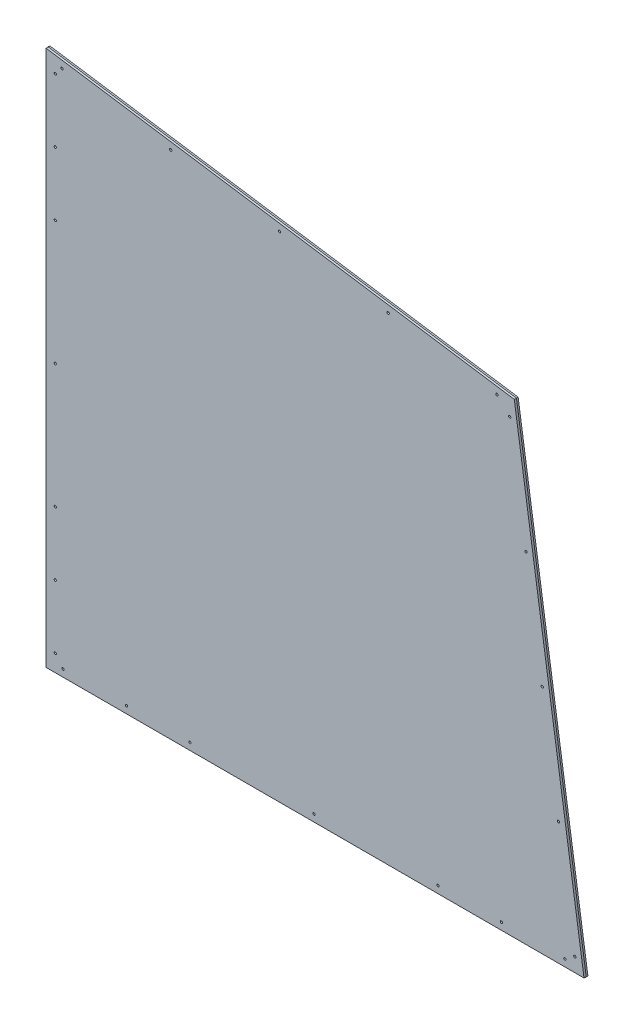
ISO-10303-21;
HEADER;
FILE_DESCRIPTION(('STEP AP214'),'2;1');
FILE_NAME('part.step','',(''),(''),'','','');
FILE_SCHEMA(('AUTOMOTIVE_DESIGN { 1 0 10303 214 1 1 1 1 }'));
ENDSEC;
DATA;
#1=APPLICATION_CONTEXT('core data for automotive mechanical design processes');
#2=APPLICATION_PROTOCOL_DEFINITION('international standard','automotive_design',2000,#1);
#3=PRODUCT_CONTEXT('',#1,'mechanical');
#4=PRODUCT('Part','Part','',(#3));
#5=PRODUCT_RELATED_PRODUCT_CATEGORY('part','',(#4));
#6=PRODUCT_DEFINITION_FORMATION('','',#4);
#7=PRODUCT_DEFINITION_CONTEXT('part definition',#1,'design');
#8=PRODUCT_DEFINITION('design','',#6,#7);
#9=PRODUCT_DEFINITION_SHAPE('','',#8);
#10=(LENGTH_UNIT() NAMED_UNIT(*) SI_UNIT(.MILLI.,.METRE.));
#11=(NAMED_UNIT(*) PLANE_ANGLE_UNIT() SI_UNIT($,.RADIAN.));
#12=(NAMED_UNIT(*) SI_UNIT($,.STERADIAN.) SOLID_ANGLE_UNIT());
#13=UNCERTAINTY_MEASURE_WITH_UNIT(LENGTH_MEASURE(1.E-05),#10,'distance_accuracy_value','');
#14=(GEOMETRIC_REPRESENTATION_CONTEXT(3) GLOBAL_UNCERTAINTY_ASSIGNED_CONTEXT((#13)) GLOBAL_UNIT_ASSIGNED_CONTEXT((#10,
#11,#12)) REPRESENTATION_CONTEXT('',''));
#15=CARTESIAN_POINT('',(0.,0.,0.));
#16=DIRECTION('',(0.,0.,1.));
#17=DIRECTION('',(1.,0.,0.));
#18=AXIS2_PLACEMENT_3D('',#15,#16,#17);
#19=CARTESIAN_POINT('',(0.,4.365625,4.365625));
#20=DIRECTION('',(0.,1.,0.));
#21=DIRECTION('',(0.,0.,1.));
#22=AXIS2_PLACEMENT_3D('',#19,#20,#21);
#23=PLANE('',#22);
#24=DIRECTION('',(1.,0.,0.));
#25=VECTOR('',#24,1.);
#26=CARTESIAN_POINT('',(0.,4.365625,-4.365625));
#27=LINE('',#26,#25);
#28=CARTESIAN_POINT('',(0.,4.365625,-4.365625));
#29=VERTEX_POINT('',#28);
#30=CARTESIAN_POINT('',(1211.54426241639,4.365625,-4.365625));
#31=VERTEX_POINT('',#30);
#32=EDGE_CURVE('E97',#29,#31,#27,.T.);
#33=ORIENTED_EDGE('',*,*,#32,.T.);
#34=DIRECTION('',(-0.147902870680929,0.,-0.989001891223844));
#35=VECTOR('',#34,1.);
#36=CARTESIAN_POINT('',(1212.19713120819,4.365625,0.));
#37=LINE('',#36,#35);
#38=CARTESIAN_POINT('',(1212.19713120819,4.365625,0.));
#39=VERTEX_POINT('',#38);
#40=EDGE_CURVE('E81',#39,#31,#37,.T.);
#41=ORIENTED_EDGE('',*,*,#40,.F.);
#42=DIRECTION('',(0.147902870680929,0.,-0.989001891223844));
#43=VECTOR('',#42,1.);
#44=CARTESIAN_POINT('',(1212.19713120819,4.365625,0.));
#45=LINE('',#44,#43);
#46=CARTESIAN_POINT('',(1211.54426241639,4.365625,4.365625));
#47=VERTEX_POINT('',#46);
#48=EDGE_CURVE('E89',#47,#39,#45,.T.);
#49=ORIENTED_EDGE('',*,*,#48,.F.);
#50=DIRECTION('',(1.,0.,0.));
#51=VECTOR('',#50,1.);
#52=CARTESIAN_POINT('',(0.,4.365625,4.365625));
#53=LINE('',#52,#51);
#54=CARTESIAN_POINT('',(0.,4.365625,4.365625));
#55=VERTEX_POINT('',#54);
#56=EDGE_CURVE('E107',#55,#47,#53,.T.);
#57=ORIENTED_EDGE('',*,*,#56,.F.);
#58=DIRECTION('',(0.,0.,-1.));
#59=VECTOR('',#58,1.);
#60=CARTESIAN_POINT('',(0.,4.365625,4.365625));
#61=LINE('',#60,#59);
#62=EDGE_CURVE('E103',#55,#29,#61,.T.);
#63=ORIENTED_EDGE('',*,*,#62,.T.);
#64=EDGE_LOOP('',(#33,#41,#49,#57,#63));
#65=FACE_BOUND('',#64,.T.);
#66=ADVANCED_FACE('F32',(#65),#23,.F.);
#67=CARTESIAN_POINT('',(0.,4.365625,4.365625));
#68=DIRECTION('',(1.,0.,0.));
#69=DIRECTION('',(0.,1.,0.));
#70=AXIS2_PLACEMENT_3D('',#67,#68,#69);
#71=PLANE('',#70);
#72=DIRECTION('',(0.,-0.147902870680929,0.989001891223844));
#73=VECTOR('',#72,1.);
#74=CARTESIAN_POINT('',(0.,1212.85,0.));
#75=LINE('',#74,#73);
#76=CARTESIAN_POINT('',(0.,1212.85,0.));
#77=VERTEX_POINT('',#76);
#78=CARTESIAN_POINT('',(0.,1212.19713120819,4.365625));
#79=VERTEX_POINT('',#78);
#80=EDGE_CURVE('E109',#77,#79,#75,.T.);
#81=ORIENTED_EDGE('',*,*,#80,.F.);
#82=DIRECTION('',(0.,0.147902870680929,0.989001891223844));
#83=VECTOR('',#82,1.);
#84=CARTESIAN_POINT('',(0.,1212.85,0.));
#85=LINE('',#84,#83);
#86=CARTESIAN_POINT('',(0.,1212.19713120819,-4.365625));
#87=VERTEX_POINT('',#86);
#88=EDGE_CURVE('E126',#87,#77,#85,.T.);
#89=ORIENTED_EDGE('',*,*,#88,.F.);
#90=DIRECTION('',(0.,-1.,0.));
#91=VECTOR('',#90,1.);
#92=CARTESIAN_POINT('',(0.,4.365625,-4.365625));
#93=LINE('',#92,#91);
#94=EDGE_CURVE('E104',#87,#29,#93,.T.);
#95=ORIENTED_EDGE('',*,*,#94,.T.);
#96=ORIENTED_EDGE('',*,*,#62,.F.);
#97=DIRECTION('',(0.,-1.,0.));
#98=VECTOR('',#97,1.);
#99=CARTESIAN_POINT('',(0.,4.365625,4.365625));
#100=LINE('',#99,#98);
#101=EDGE_CURVE('E55',#79,#55,#100,.T.);
#102=ORIENTED_EDGE('',*,*,#101,.F.);
#103=EDGE_LOOP('',(#81,#89,#95,#96,#102));
#104=FACE_BOUND('',#103,.T.);
#105=ADVANCED_FACE('F133',(#104),#71,.F.);
#106=CARTESIAN_POINT('',(0.,0.,4.365625));
#107=DIRECTION('',(0.,0.,1.));
#108=DIRECTION('',(1.,0.,0.));
#109=AXIS2_PLACEMENT_3D('',#106,#107,#108);
#110=PLANE('',#109);
#111=CARTESIAN_POINT('',(280.602864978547,1154.13041917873,4.365625));
#112=DIRECTION('',(0.,0.,1.));
#113=DIRECTION('',(1.,0.,0.));
#114=AXIS2_PLACEMENT_3D('',#111,#112,#113);
#115=CIRCLE('',#114,2.57937000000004);
#116=CARTESIAN_POINT('',(283.182234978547,1154.13041917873,4.365625));
#117=VERTEX_POINT('',#116);
#118=EDGE_CURVE('E277',#117,#117,#115,.T.);
#119=ORIENTED_EDGE('',*,*,#118,.F.);
#120=EDGE_LOOP('',(#119));
#121=FACE_BOUND('',#120,.T.);
#122=CARTESIAN_POINT('',(35.6765466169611,1190.75856510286,4.365625));
#123=DIRECTION('',(0.,0.,1.));
#124=DIRECTION('',(1.,0.,0.));
#125=AXIS2_PLACEMENT_3D('',#122,#123,#124);
#126=CIRCLE('',#125,2.57937000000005);
#127=CARTESIAN_POINT('',(38.2559166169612,1190.75856510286,4.365625));
#128=VERTEX_POINT('',#127);
#129=EDGE_CURVE('E271',#128,#128,#126,.T.);
#130=ORIENTED_EDGE('',*,*,#129,.F.);
#131=EDGE_LOOP('',(#130));
#132=FACE_BOUND('',#131,.T.);
#133=CARTESIAN_POINT('',(20.6375,1172.765625,4.365625));
#134=DIRECTION('',(0.,0.,1.));
#135=DIRECTION('',(1.,0.,0.));
#136=AXIS2_PLACEMENT_3D('',#133,#134,#135);
#137=CIRCLE('',#136,2.57937000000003);
#138=CARTESIAN_POINT('',(23.21687,1172.765625,4.365625));
#139=VERTEX_POINT('',#138);
#140=EDGE_CURVE('E265',#139,#139,#137,.T.);
#141=ORIENTED_EDGE('',*,*,#140,.F.);
#142=EDGE_LOOP('',(#141));
#143=FACE_BOUND('',#142,.T.);
#144=CARTESIAN_POINT('',(20.6375,1029.890625,4.365625));
#145=DIRECTION('',(0.,0.,1.));
#146=DIRECTION('',(1.,0.,0.));
#147=AXIS2_PLACEMENT_3D('',#144,#145,#146);
#148=CIRCLE('',#147,2.57937000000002);
#149=CARTESIAN_POINT('',(23.21687,1029.890625,4.365625));
#150=VERTEX_POINT('',#149);
#151=EDGE_CURVE('E259',#150,#150,#148,.T.);
#152=ORIENTED_EDGE('',*,*,#151,.F.);
#153=EDGE_LOOP('',(#152));
#154=FACE_BOUND('',#153,.T.);
#155=CARTESIAN_POINT('',(20.6375,887.015625,4.365625));
#156=DIRECTION('',(0.,0.,1.));
#157=DIRECTION('',(1.,0.,0.));
#158=AXIS2_PLACEMENT_3D('',#155,#156,#157);
#159=CIRCLE('',#158,2.57936999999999);
#160=CARTESIAN_POINT('',(23.21687,887.015625,4.365625));
#161=VERTEX_POINT('',#160);
#162=EDGE_CURVE('E253',#161,#161,#159,.T.);
#163=ORIENTED_EDGE('',*,*,#162,.F.);
#164=EDGE_LOOP('',(#163));
#165=FACE_BOUND('',#164,.T.);
#166=CARTESIAN_POINT('',(20.6375,607.615625,4.365625));
#167=DIRECTION('',(0.,0.,1.));
#168=DIRECTION('',(1.,0.,0.));
#169=AXIS2_PLACEMENT_3D('',#166,#167,#168);
#170=CIRCLE('',#169,2.57936999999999);
#171=CARTESIAN_POINT('',(23.21687,607.615625,4.365625));
#172=VERTEX_POINT('',#171);
#173=EDGE_CURVE('E247',#172,#172,#170,.T.);
#174=ORIENTED_EDGE('',*,*,#173,.F.);
#175=EDGE_LOOP('',(#174));
#176=FACE_BOUND('',#175,.T.);
#177=CARTESIAN_POINT('',(20.6375,328.215625,4.365625));
#178=DIRECTION('',(0.,0.,1.));
#179=DIRECTION('',(1.,0.,0.));
#180=AXIS2_PLACEMENT_3D('',#177,#178,#179);
#181=CIRCLE('',#180,2.57937000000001);
#182=CARTESIAN_POINT('',(23.21687,328.215625,4.365625));
#183=VERTEX_POINT('',#182);
#184=EDGE_CURVE('E241',#183,#183,#181,.T.);
#185=ORIENTED_EDGE('',*,*,#184,.F.);
#186=EDGE_LOOP('',(#185));
#187=FACE_BOUND('',#186,.T.);
#188=CARTESIAN_POINT('',(20.6375,185.340625,4.365625));
#189=DIRECTION('',(0.,0.,1.));
#190=DIRECTION('',(1.,0.,0.));
#191=AXIS2_PLACEMENT_3D('',#188,#189,#190);
#192=CIRCLE('',#191,2.57937);
#193=CARTESIAN_POINT('',(23.21687,185.340625,4.365625));
#194=VERTEX_POINT('',#193);
#195=EDGE_CURVE('E235',#194,#194,#192,.T.);
#196=ORIENTED_EDGE('',*,*,#195,.F.);
#197=EDGE_LOOP('',(#196));
#198=FACE_BOUND('',#197,.T.);
#199=CARTESIAN_POINT('',(20.6375,42.465625,4.365625));
#200=DIRECTION('',(0.,0.,1.));
#201=DIRECTION('',(1.,0.,0.));
#202=AXIS2_PLACEMENT_3D('',#199,#200,#201);
#203=CIRCLE('',#202,2.57937);
#204=CARTESIAN_POINT('',(23.21687,42.465625,4.365625));
#205=VERTEX_POINT('',#204);
#206=EDGE_CURVE('E229',#205,#205,#203,.T.);
#207=ORIENTED_EDGE('',*,*,#206,.F.);
#208=EDGE_LOOP('',(#207));
#209=FACE_BOUND('',#208,.T.);
#210=CARTESIAN_POINT('',(38.1,20.240625,4.365625));
#211=DIRECTION('',(0.,0.,1.));
#212=DIRECTION('',(1.,0.,0.));
#213=AXIS2_PLACEMENT_3D('',#210,#211,#212);
#214=CIRCLE('',#213,2.57937);
#215=CARTESIAN_POINT('',(40.67937,20.240625,4.365625));
#216=VERTEX_POINT('',#215);
#217=EDGE_CURVE('E223',#216,#216,#214,.T.);
#218=ORIENTED_EDGE('',*,*,#217,.F.);
#219=EDGE_LOOP('',(#218));
#220=FACE_BOUND('',#219,.T.);
#221=CARTESIAN_POINT('',(180.975,20.240625,4.365625));
#222=DIRECTION('',(0.,0.,1.));
#223=DIRECTION('',(1.,0.,0.));
#224=AXIS2_PLACEMENT_3D('',#221,#222,#223);
#225=CIRCLE('',#224,2.57936999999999);
#226=CARTESIAN_POINT('',(183.55437,20.240625,4.365625));
#227=VERTEX_POINT('',#226);
#228=EDGE_CURVE('E217',#227,#227,#225,.T.);
#229=ORIENTED_EDGE('',*,*,#228,.F.);
#230=EDGE_LOOP('',(#229));
#231=FACE_BOUND('',#230,.T.);
#232=CARTESIAN_POINT('',(323.85,20.240625,4.365625));
#233=DIRECTION('',(0.,0.,1.));
#234=DIRECTION('',(1.,0.,0.));
#235=AXIS2_PLACEMENT_3D('',#232,#233,#234);
#236=CIRCLE('',#235,2.57937000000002);
#237=CARTESIAN_POINT('',(326.42937,20.240625,4.365625));
#238=VERTEX_POINT('',#237);
#239=EDGE_CURVE('E211',#238,#238,#236,.T.);
#240=ORIENTED_EDGE('',*,*,#239,.F.);
#241=EDGE_LOOP('',(#240));
#242=FACE_BOUND('',#241,.T.);
#243=CARTESIAN_POINT('',(603.25,20.240625,4.365625));
#244=DIRECTION('',(0.,0.,1.));
#245=DIRECTION('',(1.,0.,0.));
#246=AXIS2_PLACEMENT_3D('',#243,#244,#245);
#247=CIRCLE('',#246,2.57936999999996);
#248=CARTESIAN_POINT('',(605.82937,20.240625,4.365625));
#249=VERTEX_POINT('',#248);
#250=EDGE_CURVE('E205',#249,#249,#247,.T.);
#251=ORIENTED_EDGE('',*,*,#250,.F.);
#252=EDGE_LOOP('',(#251));
#253=FACE_BOUND('',#252,.T.);
#254=CARTESIAN_POINT('',(882.65,20.240625,4.365625));
#255=DIRECTION('',(0.,0.,1.));
#256=DIRECTION('',(1.,0.,0.));
#257=AXIS2_PLACEMENT_3D('',#254,#255,#256);
#258=CIRCLE('',#257,2.57936999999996);
#259=CARTESIAN_POINT('',(885.22937,20.240625,4.365625));
#260=VERTEX_POINT('',#259);
#261=EDGE_CURVE('E199',#260,#260,#258,.T.);
#262=ORIENTED_EDGE('',*,*,#261,.F.);
#263=EDGE_LOOP('',(#262));
#264=FACE_BOUND('',#263,.T.);
#265=CARTESIAN_POINT('',(1025.525,20.240625,4.365625));
#266=DIRECTION('',(0.,0.,1.));
#267=DIRECTION('',(1.,0.,0.));
#268=AXIS2_PLACEMENT_3D('',#265,#266,#267);
#269=CIRCLE('',#268,2.57937000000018);
#270=CARTESIAN_POINT('',(1028.10437,20.240625,4.365625));
#271=VERTEX_POINT('',#270);
#272=EDGE_CURVE('E193',#271,#271,#269,.T.);
#273=ORIENTED_EDGE('',*,*,#272,.F.);
#274=EDGE_LOOP('',(#273));
#275=FACE_BOUND('',#274,.T.);
#276=CARTESIAN_POINT('',(1168.4,20.240625,4.365625));
#277=DIRECTION('',(0.,0.,1.));
#278=DIRECTION('',(1.,0.,0.));
#279=AXIS2_PLACEMENT_3D('',#276,#277,#278);
#280=CIRCLE('',#279,2.57937000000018);
#281=CARTESIAN_POINT('',(1170.97937,20.240625,4.365625));
#282=VERTEX_POINT('',#281);
#283=EDGE_CURVE('E187',#282,#282,#280,.T.);
#284=ORIENTED_EDGE('',*,*,#283,.F.);
#285=EDGE_LOOP('',(#284));
#286=FACE_BOUND('',#285,.T.);
#287=CARTESIAN_POINT('',(1190.75856510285,35.6765466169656,4.365625));
#288=DIRECTION('',(0.,0.,1.));
#289=DIRECTION('',(1.,0.,0.));
#290=AXIS2_PLACEMENT_3D('',#287,#288,#289);
#291=CIRCLE('',#290,2.57937000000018);
#292=CARTESIAN_POINT('',(1193.33793510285,35.6765466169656,4.365625));
#293=VERTEX_POINT('',#292);
#294=EDGE_CURVE('E181',#293,#293,#291,.T.);
#295=ORIENTED_EDGE('',*,*,#294,.F.);
#296=EDGE_LOOP('',(#295));
#297=FACE_BOUND('',#296,.T.);
#298=CARTESIAN_POINT('',(1154.13041917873,280.602864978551,4.365625));
#299=DIRECTION('',(0.,0.,1.));
#300=DIRECTION('',(1.,0.,0.));
#301=AXIS2_PLACEMENT_3D('',#298,#299,#300);
#302=CIRCLE('',#301,2.57936999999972);
#303=CARTESIAN_POINT('',(1156.70978917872,280.602864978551,4.365625));
#304=VERTEX_POINT('',#303);
#305=EDGE_CURVE('E175',#304,#304,#302,.T.);
#306=ORIENTED_EDGE('',*,*,#305,.F.);
#307=EDGE_LOOP('',(#306));
#308=FACE_BOUND('',#307,.T.);
#309=CARTESIAN_POINT('',(1117.5022732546,525.529183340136,4.365625));
#310=DIRECTION('',(0.,0.,1.));
#311=DIRECTION('',(1.,0.,0.));
#312=AXIS2_PLACEMENT_3D('',#309,#310,#311);
#313=CIRCLE('',#312,2.5793700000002);
#314=CARTESIAN_POINT('',(1120.0816432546,525.529183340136,4.365625));
#315=VERTEX_POINT('',#314);
#316=EDGE_CURVE('E169',#315,#315,#313,.T.);
#317=ORIENTED_EDGE('',*,*,#316,.F.);
#318=EDGE_LOOP('',(#317));
#319=FACE_BOUND('',#318,.T.);
#320=CARTESIAN_POINT('',(1080.87412733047,770.455501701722,4.365625));
#321=DIRECTION('',(0.,0.,1.));
#322=DIRECTION('',(1.,0.,0.));
#323=AXIS2_PLACEMENT_3D('',#320,#321,#322);
#324=CIRCLE('',#323,2.5793700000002);
#325=CARTESIAN_POINT('',(1083.45349733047,770.455501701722,4.365625));
#326=VERTEX_POINT('',#325);
#327=EDGE_CURVE('E163',#326,#326,#324,.T.);
#328=ORIENTED_EDGE('',*,*,#327,.F.);
#329=EDGE_LOOP('',(#328));
#330=FACE_BOUND('',#329,.T.);
#331=CARTESIAN_POINT('',(1044.24598140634,1015.38182006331,4.365625));
#332=DIRECTION('',(0.,0.,1.));
#333=DIRECTION('',(1.,0.,0.));
#334=AXIS2_PLACEMENT_3D('',#331,#332,#333);
#335=CIRCLE('',#334,2.57937000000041);
#336=CARTESIAN_POINT('',(1046.82535140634,1015.38182006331,4.365625));
#337=VERTEX_POINT('',#336);
#338=EDGE_CURVE('E157',#337,#337,#335,.T.);
#339=ORIENTED_EDGE('',*,*,#338,.F.);
#340=EDGE_LOOP('',(#339));
#341=FACE_BOUND('',#340,.T.);
#342=CARTESIAN_POINT('',(1015.3818200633,1044.24598140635,4.365625));
#343=DIRECTION('',(0.,0.,1.));
#344=DIRECTION('',(1.,0.,0.));
#345=AXIS2_PLACEMENT_3D('',#342,#343,#344);
#346=CIRCLE('',#345,2.5793700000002);
#347=CARTESIAN_POINT('',(1017.9611900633,1044.24598140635,4.365625));
#348=VERTEX_POINT('',#347);
#349=EDGE_CURVE('E151',#348,#348,#346,.T.);
#350=ORIENTED_EDGE('',*,*,#349,.F.);
#351=EDGE_LOOP('',(#350));
#352=FACE_BOUND('',#351,.T.);
#353=CARTESIAN_POINT('',(770.455501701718,1080.87412733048,4.365625));
#354=DIRECTION('',(0.,0.,1.));
#355=DIRECTION('',(1.,0.,0.));
#356=AXIS2_PLACEMENT_3D('',#353,#354,#355);
#357=CIRCLE('',#356,2.57936999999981);
#358=CARTESIAN_POINT('',(773.034871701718,1080.87412733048,4.365625));
#359=VERTEX_POINT('',#358);
#360=EDGE_CURVE('E145',#359,#359,#357,.T.);
#361=ORIENTED_EDGE('',*,*,#360,.F.);
#362=EDGE_LOOP('',(#361));
#363=FACE_BOUND('',#362,.T.);
#364=CARTESIAN_POINT('',(525.529183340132,1117.50227325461,4.365625));
#365=DIRECTION('',(0.,0.,1.));
#366=DIRECTION('',(1.,0.,0.));
#367=AXIS2_PLACEMENT_3D('',#364,#365,#366);
#368=CIRCLE('',#367,2.57936999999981);
#369=CARTESIAN_POINT('',(528.108553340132,1117.50227325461,4.365625));
#370=VERTEX_POINT('',#369);
#371=EDGE_CURVE('E139',#370,#370,#368,.T.);
#372=ORIENTED_EDGE('',*,*,#371,.F.);
#373=EDGE_LOOP('',(#372));
#374=FACE_BOUND('',#373,.T.);
#375=DIRECTION('',(0.147902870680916,-0.989001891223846,0.));
#376=VECTOR('',#375,1.);
#377=CARTESIAN_POINT('',(1008.19904798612,1364.10124552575,4.365625));
#378=LINE('',#377,#376);
#379=CARTESIAN_POINT('',(1054.49928214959,1054.49928214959,4.365625));
#380=VERTEX_POINT('',#379);
#381=EDGE_CURVE('E99',#380,#47,#378,.T.);
#382=ORIENTED_EDGE('',*,*,#381,.F.);
#383=DIRECTION('',(0.989001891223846,-0.147902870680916,0.));
#384=VECTOR('',#383,1.);
#385=CARTESIAN_POINT('',(177.315612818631,1185.68000481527,4.365625));
#386=LINE('',#385,#384);
#387=EDGE_CURVE('E116',#79,#380,#386,.T.);
#388=ORIENTED_EDGE('',*,*,#387,.F.);
#389=ORIENTED_EDGE('',*,*,#101,.T.);
#390=ORIENTED_EDGE('',*,*,#56,.T.);
#391=EDGE_LOOP('',(#382,#388,#389,#390));
#392=FACE_BOUND('',#391,.T.);
#393=ADVANCED_FACE('F131',(#121,#132,#143,#154,#165,#176,#187,#198,#209,#220,#231,#242,#253,
#264,#275,#286,#297,#308,#319,#330,#341,#352,#363,#374,#392),#110,.T.);
#394=CARTESIAN_POINT('',(0.,0.,-4.365625));
#395=DIRECTION('',(0.,0.,1.));
#396=DIRECTION('',(1.,0.,0.));
#397=AXIS2_PLACEMENT_3D('',#394,#395,#396);
#398=PLANE('',#397);
#399=CARTESIAN_POINT('',(280.602864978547,1154.13041917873,-4.365625));
#400=DIRECTION('',(0.,0.,1.));
#401=DIRECTION('',(1.,0.,0.));
#402=AXIS2_PLACEMENT_3D('',#399,#400,#401);
#403=CIRCLE('',#402,2.57937000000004);
#404=CARTESIAN_POINT('',(283.182234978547,1154.13041917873,-4.365625));
#405=VERTEX_POINT('',#404);
#406=EDGE_CURVE('E274',#405,#405,#403,.T.);
#407=ORIENTED_EDGE('',*,*,#406,.T.);
#408=EDGE_LOOP('',(#407));
#409=FACE_BOUND('',#408,.T.);
#410=CARTESIAN_POINT('',(35.6765466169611,1190.75856510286,-4.365625));
#411=DIRECTION('',(0.,0.,1.));
#412=DIRECTION('',(1.,0.,0.));
#413=AXIS2_PLACEMENT_3D('',#410,#411,#412);
#414=CIRCLE('',#413,2.57937000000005);
#415=CARTESIAN_POINT('',(38.2559166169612,1190.75856510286,-4.365625));
#416=VERTEX_POINT('',#415);
#417=EDGE_CURVE('E268',#416,#416,#414,.T.);
#418=ORIENTED_EDGE('',*,*,#417,.T.);
#419=EDGE_LOOP('',(#418));
#420=FACE_BOUND('',#419,.T.);
#421=CARTESIAN_POINT('',(20.6375,1172.765625,-4.365625));
#422=DIRECTION('',(0.,0.,1.));
#423=DIRECTION('',(1.,0.,0.));
#424=AXIS2_PLACEMENT_3D('',#421,#422,#423);
#425=CIRCLE('',#424,2.57937000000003);
#426=CARTESIAN_POINT('',(23.21687,1172.765625,-4.365625));
#427=VERTEX_POINT('',#426);
#428=EDGE_CURVE('E262',#427,#427,#425,.T.);
#429=ORIENTED_EDGE('',*,*,#428,.T.);
#430=EDGE_LOOP('',(#429));
#431=FACE_BOUND('',#430,.T.);
#432=CARTESIAN_POINT('',(20.6375,1029.890625,-4.365625));
#433=DIRECTION('',(0.,0.,1.));
#434=DIRECTION('',(1.,0.,0.));
#435=AXIS2_PLACEMENT_3D('',#432,#433,#434);
#436=CIRCLE('',#435,2.57937000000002);
#437=CARTESIAN_POINT('',(23.21687,1029.890625,-4.365625));
#438=VERTEX_POINT('',#437);
#439=EDGE_CURVE('E256',#438,#438,#436,.T.);
#440=ORIENTED_EDGE('',*,*,#439,.T.);
#441=EDGE_LOOP('',(#440));
#442=FACE_BOUND('',#441,.T.);
#443=CARTESIAN_POINT('',(20.6375,887.015625,-4.365625));
#444=DIRECTION('',(0.,0.,1.));
#445=DIRECTION('',(1.,0.,0.));
#446=AXIS2_PLACEMENT_3D('',#443,#444,#445);
#447=CIRCLE('',#446,2.57936999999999);
#448=CARTESIAN_POINT('',(23.21687,887.015625,-4.365625));
#449=VERTEX_POINT('',#448);
#450=EDGE_CURVE('E250',#449,#449,#447,.T.);
#451=ORIENTED_EDGE('',*,*,#450,.T.);
#452=EDGE_LOOP('',(#451));
#453=FACE_BOUND('',#452,.T.);
#454=CARTESIAN_POINT('',(20.6375,607.615625,-4.365625));
#455=DIRECTION('',(0.,0.,1.));
#456=DIRECTION('',(1.,0.,0.));
#457=AXIS2_PLACEMENT_3D('',#454,#455,#456);
#458=CIRCLE('',#457,2.57936999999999);
#459=CARTESIAN_POINT('',(23.21687,607.615625,-4.365625));
#460=VERTEX_POINT('',#459);
#461=EDGE_CURVE('E244',#460,#460,#458,.T.);
#462=ORIENTED_EDGE('',*,*,#461,.T.);
#463=EDGE_LOOP('',(#462));
#464=FACE_BOUND('',#463,.T.);
#465=CARTESIAN_POINT('',(20.6375,328.215625,-4.365625));
#466=DIRECTION('',(0.,0.,1.));
#467=DIRECTION('',(1.,0.,0.));
#468=AXIS2_PLACEMENT_3D('',#465,#466,#467);
#469=CIRCLE('',#468,2.57937000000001);
#470=CARTESIAN_POINT('',(23.21687,328.215625,-4.365625));
#471=VERTEX_POINT('',#470);
#472=EDGE_CURVE('E238',#471,#471,#469,.T.);
#473=ORIENTED_EDGE('',*,*,#472,.T.);
#474=EDGE_LOOP('',(#473));
#475=FACE_BOUND('',#474,.T.);
#476=CARTESIAN_POINT('',(20.6375,185.340625,-4.365625));
#477=DIRECTION('',(0.,0.,1.));
#478=DIRECTION('',(1.,0.,0.));
#479=AXIS2_PLACEMENT_3D('',#476,#477,#478);
#480=CIRCLE('',#479,2.57937);
#481=CARTESIAN_POINT('',(23.21687,185.340625,-4.365625));
#482=VERTEX_POINT('',#481);
#483=EDGE_CURVE('E232',#482,#482,#480,.T.);
#484=ORIENTED_EDGE('',*,*,#483,.T.);
#485=EDGE_LOOP('',(#484));
#486=FACE_BOUND('',#485,.T.);
#487=CARTESIAN_POINT('',(20.6375,42.465625,-4.365625));
#488=DIRECTION('',(0.,0.,1.));
#489=DIRECTION('',(1.,0.,0.));
#490=AXIS2_PLACEMENT_3D('',#487,#488,#489);
#491=CIRCLE('',#490,2.57937);
#492=CARTESIAN_POINT('',(23.21687,42.465625,-4.365625));
#493=VERTEX_POINT('',#492);
#494=EDGE_CURVE('E226',#493,#493,#491,.T.);
#495=ORIENTED_EDGE('',*,*,#494,.T.);
#496=EDGE_LOOP('',(#495));
#497=FACE_BOUND('',#496,.T.);
#498=CARTESIAN_POINT('',(38.1,20.240625,-4.365625));
#499=DIRECTION('',(0.,0.,1.));
#500=DIRECTION('',(1.,0.,0.));
#501=AXIS2_PLACEMENT_3D('',#498,#499,#500);
#502=CIRCLE('',#501,2.57937);
#503=CARTESIAN_POINT('',(40.67937,20.240625,-4.365625));
#504=VERTEX_POINT('',#503);
#505=EDGE_CURVE('E220',#504,#504,#502,.T.);
#506=ORIENTED_EDGE('',*,*,#505,.T.);
#507=EDGE_LOOP('',(#506));
#508=FACE_BOUND('',#507,.T.);
#509=CARTESIAN_POINT('',(180.975,20.240625,-4.365625));
#510=DIRECTION('',(0.,0.,1.));
#511=DIRECTION('',(1.,0.,0.));
#512=AXIS2_PLACEMENT_3D('',#509,#510,#511);
#513=CIRCLE('',#512,2.57936999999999);
#514=CARTESIAN_POINT('',(183.55437,20.240625,-4.365625));
#515=VERTEX_POINT('',#514);
#516=EDGE_CURVE('E214',#515,#515,#513,.T.);
#517=ORIENTED_EDGE('',*,*,#516,.T.);
#518=EDGE_LOOP('',(#517));
#519=FACE_BOUND('',#518,.T.);
#520=CARTESIAN_POINT('',(323.85,20.240625,-4.365625));
#521=DIRECTION('',(0.,0.,1.));
#522=DIRECTION('',(1.,0.,0.));
#523=AXIS2_PLACEMENT_3D('',#520,#521,#522);
#524=CIRCLE('',#523,2.57937000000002);
#525=CARTESIAN_POINT('',(326.42937,20.240625,-4.365625));
#526=VERTEX_POINT('',#525);
#527=EDGE_CURVE('E208',#526,#526,#524,.T.);
#528=ORIENTED_EDGE('',*,*,#527,.T.);
#529=EDGE_LOOP('',(#528));
#530=FACE_BOUND('',#529,.T.);
#531=CARTESIAN_POINT('',(603.25,20.240625,-4.365625));
#532=DIRECTION('',(0.,0.,1.));
#533=DIRECTION('',(1.,0.,0.));
#534=AXIS2_PLACEMENT_3D('',#531,#532,#533);
#535=CIRCLE('',#534,2.57936999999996);
#536=CARTESIAN_POINT('',(605.82937,20.240625,-4.365625));
#537=VERTEX_POINT('',#536);
#538=EDGE_CURVE('E202',#537,#537,#535,.T.);
#539=ORIENTED_EDGE('',*,*,#538,.T.);
#540=EDGE_LOOP('',(#539));
#541=FACE_BOUND('',#540,.T.);
#542=CARTESIAN_POINT('',(882.65,20.240625,-4.365625));
#543=DIRECTION('',(0.,0.,1.));
#544=DIRECTION('',(1.,0.,0.));
#545=AXIS2_PLACEMENT_3D('',#542,#543,#544);
#546=CIRCLE('',#545,2.57936999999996);
#547=CARTESIAN_POINT('',(885.22937,20.240625,-4.365625));
#548=VERTEX_POINT('',#547);
#549=EDGE_CURVE('E196',#548,#548,#546,.T.);
#550=ORIENTED_EDGE('',*,*,#549,.T.);
#551=EDGE_LOOP('',(#550));
#552=FACE_BOUND('',#551,.T.);
#553=CARTESIAN_POINT('',(1025.525,20.240625,-4.365625));
#554=DIRECTION('',(0.,0.,1.));
#555=DIRECTION('',(1.,0.,0.));
#556=AXIS2_PLACEMENT_3D('',#553,#554,#555);
#557=CIRCLE('',#556,2.57937000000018);
#558=CARTESIAN_POINT('',(1028.10437,20.240625,-4.365625));
#559=VERTEX_POINT('',#558);
#560=EDGE_CURVE('E190',#559,#559,#557,.T.);
#561=ORIENTED_EDGE('',*,*,#560,.T.);
#562=EDGE_LOOP('',(#561));
#563=FACE_BOUND('',#562,.T.);
#564=CARTESIAN_POINT('',(1168.4,20.240625,-4.365625));
#565=DIRECTION('',(0.,0.,1.));
#566=DIRECTION('',(1.,0.,0.));
#567=AXIS2_PLACEMENT_3D('',#564,#565,#566);
#568=CIRCLE('',#567,2.57937000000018);
#569=CARTESIAN_POINT('',(1170.97937,20.240625,-4.365625));
#570=VERTEX_POINT('',#569);
#571=EDGE_CURVE('E184',#570,#570,#568,.T.);
#572=ORIENTED_EDGE('',*,*,#571,.T.);
#573=EDGE_LOOP('',(#572));
#574=FACE_BOUND('',#573,.T.);
#575=CARTESIAN_POINT('',(1190.75856510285,35.6765466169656,-4.365625));
#576=DIRECTION('',(0.,0.,1.));
#577=DIRECTION('',(1.,0.,0.));
#578=AXIS2_PLACEMENT_3D('',#575,#576,#577);
#579=CIRCLE('',#578,2.57937000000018);
#580=CARTESIAN_POINT('',(1193.33793510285,35.6765466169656,-4.365625));
#581=VERTEX_POINT('',#580);
#582=EDGE_CURVE('E178',#581,#581,#579,.T.);
#583=ORIENTED_EDGE('',*,*,#582,.T.);
#584=EDGE_LOOP('',(#583));
#585=FACE_BOUND('',#584,.T.);
#586=CARTESIAN_POINT('',(1154.13041917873,280.602864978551,-4.365625));
#587=DIRECTION('',(0.,0.,1.));
#588=DIRECTION('',(1.,0.,0.));
#589=AXIS2_PLACEMENT_3D('',#586,#587,#588);
#590=CIRCLE('',#589,2.57936999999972);
#591=CARTESIAN_POINT('',(1156.70978917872,280.602864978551,-4.365625));
#592=VERTEX_POINT('',#591);
#593=EDGE_CURVE('E172',#592,#592,#590,.T.);
#594=ORIENTED_EDGE('',*,*,#593,.T.);
#595=EDGE_LOOP('',(#594));
#596=FACE_BOUND('',#595,.T.);
#597=CARTESIAN_POINT('',(1117.5022732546,525.529183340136,-4.365625));
#598=DIRECTION('',(0.,0.,1.));
#599=DIRECTION('',(1.,0.,0.));
#600=AXIS2_PLACEMENT_3D('',#597,#598,#599);
#601=CIRCLE('',#600,2.5793700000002);
#602=CARTESIAN_POINT('',(1120.0816432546,525.529183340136,-4.365625));
#603=VERTEX_POINT('',#602);
#604=EDGE_CURVE('E166',#603,#603,#601,.T.);
#605=ORIENTED_EDGE('',*,*,#604,.T.);
#606=EDGE_LOOP('',(#605));
#607=FACE_BOUND('',#606,.T.);
#608=CARTESIAN_POINT('',(1080.87412733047,770.455501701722,-4.365625));
#609=DIRECTION('',(0.,0.,1.));
#610=DIRECTION('',(1.,0.,0.));
#611=AXIS2_PLACEMENT_3D('',#608,#609,#610);
#612=CIRCLE('',#611,2.5793700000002);
#613=CARTESIAN_POINT('',(1083.45349733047,770.455501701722,-4.365625));
#614=VERTEX_POINT('',#613);
#615=EDGE_CURVE('E160',#614,#614,#612,.T.);
#616=ORIENTED_EDGE('',*,*,#615,.T.);
#617=EDGE_LOOP('',(#616));
#618=FACE_BOUND('',#617,.T.);
#619=CARTESIAN_POINT('',(1044.24598140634,1015.38182006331,-4.365625));
#620=DIRECTION('',(0.,0.,1.));
#621=DIRECTION('',(1.,0.,0.));
#622=AXIS2_PLACEMENT_3D('',#619,#620,#621);
#623=CIRCLE('',#622,2.57937000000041);
#624=CARTESIAN_POINT('',(1046.82535140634,1015.38182006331,-4.365625));
#625=VERTEX_POINT('',#624);
#626=EDGE_CURVE('E154',#625,#625,#623,.T.);
#627=ORIENTED_EDGE('',*,*,#626,.T.);
#628=EDGE_LOOP('',(#627));
#629=FACE_BOUND('',#628,.T.);
#630=CARTESIAN_POINT('',(1015.3818200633,1044.24598140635,-4.365625));
#631=DIRECTION('',(0.,0.,1.));
#632=DIRECTION('',(1.,0.,0.));
#633=AXIS2_PLACEMENT_3D('',#630,#631,#632);
#634=CIRCLE('',#633,2.5793700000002);
#635=CARTESIAN_POINT('',(1017.9611900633,1044.24598140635,-4.365625));
#636=VERTEX_POINT('',#635);
#637=EDGE_CURVE('E148',#636,#636,#634,.T.);
#638=ORIENTED_EDGE('',*,*,#637,.T.);
#639=EDGE_LOOP('',(#638));
#640=FACE_BOUND('',#639,.T.);
#641=CARTESIAN_POINT('',(770.455501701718,1080.87412733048,-4.365625));
#642=DIRECTION('',(0.,0.,1.));
#643=DIRECTION('',(1.,0.,0.));
#644=AXIS2_PLACEMENT_3D('',#641,#642,#643);
#645=CIRCLE('',#644,2.57936999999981);
#646=CARTESIAN_POINT('',(773.034871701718,1080.87412733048,-4.365625));
#647=VERTEX_POINT('',#646);
#648=EDGE_CURVE('E142',#647,#647,#645,.T.);
#649=ORIENTED_EDGE('',*,*,#648,.T.);
#650=EDGE_LOOP('',(#649));
#651=FACE_BOUND('',#650,.T.);
#652=CARTESIAN_POINT('',(525.529183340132,1117.50227325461,-4.365625));
#653=DIRECTION('',(0.,0.,1.));
#654=DIRECTION('',(1.,0.,0.));
#655=AXIS2_PLACEMENT_3D('',#652,#653,#654);
#656=CIRCLE('',#655,2.57936999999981);
#657=CARTESIAN_POINT('',(528.108553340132,1117.50227325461,-4.365625));
#658=VERTEX_POINT('',#657);
#659=EDGE_CURVE('E90',#658,#658,#656,.T.);
#660=ORIENTED_EDGE('',*,*,#659,.T.);
#661=EDGE_LOOP('',(#660));
#662=FACE_BOUND('',#661,.T.);
#663=DIRECTION('',(0.989001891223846,-0.147902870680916,0.));
#664=VECTOR('',#663,1.);
#665=CARTESIAN_POINT('',(177.315612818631,1185.68000481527,-4.365625));
#666=LINE('',#665,#664);
#667=CARTESIAN_POINT('',(1054.49928214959,1054.49928214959,-4.365625));
#668=VERTEX_POINT('',#667);
#669=EDGE_CURVE('E98',#87,#668,#666,.T.);
#670=ORIENTED_EDGE('',*,*,#669,.T.);
#671=DIRECTION('',(0.147902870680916,-0.989001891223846,0.));
#672=VECTOR('',#671,1.);
#673=CARTESIAN_POINT('',(1008.19904798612,1364.10124552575,-4.365625));
#674=LINE('',#673,#672);
#675=EDGE_CURVE('E46',#668,#31,#674,.T.);
#676=ORIENTED_EDGE('',*,*,#675,.T.);
#677=ORIENTED_EDGE('',*,*,#32,.F.);
#678=ORIENTED_EDGE('',*,*,#94,.F.);
#679=EDGE_LOOP('',(#670,#676,#677,#678));
#680=FACE_BOUND('',#679,.T.);
#681=ADVANCED_FACE('F95',(#409,#420,#431,#442,#453,#464,#475,#486,#497,#508,#519,#530,#541,#552,
#563,#574,#585,#596,#607,#618,#629,#640,#651,#662,#680),#398,.F.);
#682=CARTESIAN_POINT('',(1362.82407129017,1009.04291513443,0.));
#683=DIRECTION('',(-0.146311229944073,-0.978358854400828,-0.146311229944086));
#684=DIRECTION('',(0.,0.147902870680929,-0.989001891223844));
#685=AXIS2_PLACEMENT_3D('',#682,#683,#684);
#686=PLANE('',#685);
#687=ORIENTED_EDGE('',*,*,#387,.T.);
#688=DIRECTION('',(0.127945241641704,0.127945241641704,-0.98349378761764));
#689=VECTOR('',#688,1.);
#690=CARTESIAN_POINT('',(1059.35177545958,1059.35177545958,-32.9346838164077));
#691=LINE('',#690,#689);
#692=CARTESIAN_POINT('',(1055.0672175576,1055.0672175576,0.));
#693=VERTEX_POINT('',#692);
#694=EDGE_CURVE('E11',#380,#693,#691,.T.);
#695=ORIENTED_EDGE('',*,*,#694,.T.);
#696=DIRECTION('',(-0.989001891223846,0.147902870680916,0.));
#697=VECTOR('',#696,1.);
#698=CARTESIAN_POINT('',(1362.82407129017,1009.04291513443,0.));
#699=LINE('',#698,#697);
#700=EDGE_CURVE('E105',#693,#77,#699,.T.);
#701=ORIENTED_EDGE('',*,*,#700,.T.);
#702=ORIENTED_EDGE('',*,*,#80,.T.);
#703=EDGE_LOOP('',(#687,#695,#701,#702));
#704=FACE_BOUND('',#703,.T.);
#705=ADVANCED_FACE('F129',(#704),#686,.F.);
#706=CARTESIAN_POINT('',(1362.82407129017,1009.04291513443,0.));
#707=DIRECTION('',(-0.146311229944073,-0.978358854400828,0.146311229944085));
#708=DIRECTION('',(0.,-0.147902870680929,-0.989001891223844));
#709=AXIS2_PLACEMENT_3D('',#706,#707,#708);
#710=PLANE('',#709);
#711=ORIENTED_EDGE('',*,*,#700,.F.);
#712=DIRECTION('',(-0.127945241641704,-0.127945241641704,-0.98349378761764));
#713=VECTOR('',#712,1.);
#714=CARTESIAN_POINT('',(1059.35177545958,1059.35177545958,32.9346838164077));
#715=LINE('',#714,#713);
#716=EDGE_CURVE('E39',#693,#668,#715,.T.);
#717=ORIENTED_EDGE('',*,*,#716,.T.);
#718=ORIENTED_EDGE('',*,*,#669,.F.);
#719=ORIENTED_EDGE('',*,*,#88,.T.);
#720=EDGE_LOOP('',(#711,#717,#718,#719));
#721=FACE_BOUND('',#720,.T.);
#722=ADVANCED_FACE('F120',(#721),#710,.F.);
#723=CARTESIAN_POINT('',(1008.85191677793,1364.10124552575,0.));
#724=DIRECTION('',(-0.978358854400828,-0.146311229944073,-0.146311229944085));
#725=DIRECTION('',(-0.147902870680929,0.,0.989001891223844));
#726=AXIS2_PLACEMENT_3D('',#723,#724,#725);
#727=PLANE('',#726);
#728=ORIENTED_EDGE('',*,*,#381,.T.);
#729=ORIENTED_EDGE('',*,*,#48,.T.);
#730=DIRECTION('',(0.147902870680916,-0.989001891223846,0.));
#731=VECTOR('',#730,1.);
#732=CARTESIAN_POINT('',(1008.85191677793,1364.10124552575,0.));
#733=LINE('',#732,#731);
#734=EDGE_CURVE('E84',#693,#39,#733,.T.);
#735=ORIENTED_EDGE('',*,*,#734,.F.);
#736=ORIENTED_EDGE('',*,*,#694,.F.);
#737=EDGE_LOOP('',(#728,#729,#735,#736));
#738=FACE_BOUND('',#737,.T.);
#739=ADVANCED_FACE('F124',(#738),#727,.F.);
#740=CARTESIAN_POINT('',(1008.85191677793,1364.10124552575,0.));
#741=DIRECTION('',(-0.978358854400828,-0.146311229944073,0.146311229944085));
#742=DIRECTION('',(0.147902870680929,0.,0.989001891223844));
#743=AXIS2_PLACEMENT_3D('',#740,#741,#742);
#744=PLANE('',#743);
#745=ORIENTED_EDGE('',*,*,#734,.T.);
#746=ORIENTED_EDGE('',*,*,#40,.T.);
#747=ORIENTED_EDGE('',*,*,#675,.F.);
#748=ORIENTED_EDGE('',*,*,#716,.F.);
#749=EDGE_LOOP('',(#745,#746,#747,#748));
#750=FACE_BOUND('',#749,.T.);
#751=ADVANCED_FACE('F82',(#750),#744,.F.);
#752=CARTESIAN_POINT('',(525.529183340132,1117.50227325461,-4.365625));
#753=DIRECTION('',(0.,0.,1.));
#754=DIRECTION('',(1.,0.,0.));
#755=AXIS2_PLACEMENT_3D('',#752,#753,#754);
#756=CYLINDRICAL_SURFACE('',#755,2.57936999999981);
#757=ORIENTED_EDGE('',*,*,#659,.F.);
#758=EDGE_LOOP('',(#757));
#759=FACE_BOUND('',#758,.T.);
#760=ORIENTED_EDGE('',*,*,#371,.T.);
#761=EDGE_LOOP('',(#760));
#762=FACE_BOUND('',#761,.T.);
#763=ADVANCED_FACE('F341',(#759,#762),#756,.F.);
#764=CARTESIAN_POINT('',(770.455501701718,1080.87412733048,-4.365625));
#765=DIRECTION('',(0.,0.,1.));
#766=DIRECTION('',(1.,0.,0.));
#767=AXIS2_PLACEMENT_3D('',#764,#765,#766);
#768=CYLINDRICAL_SURFACE('',#767,2.57936999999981);
#769=ORIENTED_EDGE('',*,*,#648,.F.);
#770=EDGE_LOOP('',(#769));
#771=FACE_BOUND('',#770,.T.);
#772=ORIENTED_EDGE('',*,*,#360,.T.);
#773=EDGE_LOOP('',(#772));
#774=FACE_BOUND('',#773,.T.);
#775=ADVANCED_FACE('F343',(#771,#774),#768,.F.);
#776=CARTESIAN_POINT('',(1015.3818200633,1044.24598140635,-4.365625));
#777=DIRECTION('',(0.,0.,1.));
#778=DIRECTION('',(1.,0.,0.));
#779=AXIS2_PLACEMENT_3D('',#776,#777,#778);
#780=CYLINDRICAL_SURFACE('',#779,2.5793700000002);
#781=ORIENTED_EDGE('',*,*,#637,.F.);
#782=EDGE_LOOP('',(#781));
#783=FACE_BOUND('',#782,.T.);
#784=ORIENTED_EDGE('',*,*,#349,.T.);
#785=EDGE_LOOP('',(#784));
#786=FACE_BOUND('',#785,.T.);
#787=ADVANCED_FACE('F350',(#783,#786),#780,.F.);
#788=CARTESIAN_POINT('',(1044.24598140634,1015.38182006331,-4.365625));
#789=DIRECTION('',(0.,0.,1.));
#790=DIRECTION('',(1.,0.,0.));
#791=AXIS2_PLACEMENT_3D('',#788,#789,#790);
#792=CYLINDRICAL_SURFACE('',#791,2.57937000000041);
#793=ORIENTED_EDGE('',*,*,#626,.F.);
#794=EDGE_LOOP('',(#793));
#795=FACE_BOUND('',#794,.T.);
#796=ORIENTED_EDGE('',*,*,#338,.T.);
#797=EDGE_LOOP('',(#796));
#798=FACE_BOUND('',#797,.T.);
#799=ADVANCED_FACE('F410',(#795,#798),#792,.F.);
#800=CARTESIAN_POINT('',(1080.87412733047,770.455501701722,-4.365625));
#801=DIRECTION('',(0.,0.,1.));
#802=DIRECTION('',(1.,0.,0.));
#803=AXIS2_PLACEMENT_3D('',#800,#801,#802);
#804=CYLINDRICAL_SURFACE('',#803,2.5793700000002);
#805=ORIENTED_EDGE('',*,*,#615,.F.);
#806=EDGE_LOOP('',(#805));
#807=FACE_BOUND('',#806,.T.);
#808=ORIENTED_EDGE('',*,*,#327,.T.);
#809=EDGE_LOOP('',(#808));
#810=FACE_BOUND('',#809,.T.);
#811=ADVANCED_FACE('F420',(#807,#810),#804,.F.);
#812=CARTESIAN_POINT('',(1117.5022732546,525.529183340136,-4.365625));
#813=DIRECTION('',(0.,0.,1.));
#814=DIRECTION('',(1.,0.,0.));
#815=AXIS2_PLACEMENT_3D('',#812,#813,#814);
#816=CYLINDRICAL_SURFACE('',#815,2.5793700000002);
#817=ORIENTED_EDGE('',*,*,#604,.F.);
#818=EDGE_LOOP('',(#817));
#819=FACE_BOUND('',#818,.T.);
#820=ORIENTED_EDGE('',*,*,#316,.T.);
#821=EDGE_LOOP('',(#820));
#822=FACE_BOUND('',#821,.T.);
#823=ADVANCED_FACE('F430',(#819,#822),#816,.F.);
#824=CARTESIAN_POINT('',(1154.13041917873,280.602864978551,-4.365625));
#825=DIRECTION('',(0.,0.,1.));
#826=DIRECTION('',(1.,0.,0.));
#827=AXIS2_PLACEMENT_3D('',#824,#825,#826);
#828=CYLINDRICAL_SURFACE('',#827,2.57936999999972);
#829=ORIENTED_EDGE('',*,*,#593,.F.);
#830=EDGE_LOOP('',(#829));
#831=FACE_BOUND('',#830,.T.);
#832=ORIENTED_EDGE('',*,*,#305,.T.);
#833=EDGE_LOOP('',(#832));
#834=FACE_BOUND('',#833,.T.);
#835=ADVANCED_FACE('F440',(#831,#834),#828,.F.);
#836=CARTESIAN_POINT('',(1190.75856510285,35.6765466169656,-4.365625));
#837=DIRECTION('',(0.,0.,1.));
#838=DIRECTION('',(1.,0.,0.));
#839=AXIS2_PLACEMENT_3D('',#836,#837,#838);
#840=CYLINDRICAL_SURFACE('',#839,2.57937000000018);
#841=ORIENTED_EDGE('',*,*,#582,.F.);
#842=EDGE_LOOP('',(#841));
#843=FACE_BOUND('',#842,.T.);
#844=ORIENTED_EDGE('',*,*,#294,.T.);
#845=EDGE_LOOP('',(#844));
#846=FACE_BOUND('',#845,.T.);
#847=ADVANCED_FACE('F450',(#843,#846),#840,.F.);
#848=CARTESIAN_POINT('',(1168.4,20.240625,-4.365625));
#849=DIRECTION('',(0.,0.,1.));
#850=DIRECTION('',(1.,0.,0.));
#851=AXIS2_PLACEMENT_3D('',#848,#849,#850);
#852=CYLINDRICAL_SURFACE('',#851,2.57937000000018);
#853=ORIENTED_EDGE('',*,*,#571,.F.);
#854=EDGE_LOOP('',(#853));
#855=FACE_BOUND('',#854,.T.);
#856=ORIENTED_EDGE('',*,*,#283,.T.);
#857=EDGE_LOOP('',(#856));
#858=FACE_BOUND('',#857,.T.);
#859=ADVANCED_FACE('F460',(#855,#858),#852,.F.);
#860=CARTESIAN_POINT('',(1025.525,20.240625,-4.365625));
#861=DIRECTION('',(0.,0.,1.));
#862=DIRECTION('',(1.,0.,0.));
#863=AXIS2_PLACEMENT_3D('',#860,#861,#862);
#864=CYLINDRICAL_SURFACE('',#863,2.57937000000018);
#865=ORIENTED_EDGE('',*,*,#560,.F.);
#866=EDGE_LOOP('',(#865));
#867=FACE_BOUND('',#866,.T.);
#868=ORIENTED_EDGE('',*,*,#272,.T.);
#869=EDGE_LOOP('',(#868));
#870=FACE_BOUND('',#869,.T.);
#871=ADVANCED_FACE('F470',(#867,#870),#864,.F.);
#872=CARTESIAN_POINT('',(882.65,20.240625,-4.365625));
#873=DIRECTION('',(0.,0.,1.));
#874=DIRECTION('',(1.,0.,0.));
#875=AXIS2_PLACEMENT_3D('',#872,#873,#874);
#876=CYLINDRICAL_SURFACE('',#875,2.57936999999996);
#877=ORIENTED_EDGE('',*,*,#549,.F.);
#878=EDGE_LOOP('',(#877));
#879=FACE_BOUND('',#878,.T.);
#880=ORIENTED_EDGE('',*,*,#261,.T.);
#881=EDGE_LOOP('',(#880));
#882=FACE_BOUND('',#881,.T.);
#883=ADVANCED_FACE('F480',(#879,#882),#876,.F.);
#884=CARTESIAN_POINT('',(603.25,20.240625,-4.365625));
#885=DIRECTION('',(0.,0.,1.));
#886=DIRECTION('',(1.,0.,0.));
#887=AXIS2_PLACEMENT_3D('',#884,#885,#886);
#888=CYLINDRICAL_SURFACE('',#887,2.57936999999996);
#889=ORIENTED_EDGE('',*,*,#538,.F.);
#890=EDGE_LOOP('',(#889));
#891=FACE_BOUND('',#890,.T.);
#892=ORIENTED_EDGE('',*,*,#250,.T.);
#893=EDGE_LOOP('',(#892));
#894=FACE_BOUND('',#893,.T.);
#895=ADVANCED_FACE('F490',(#891,#894),#888,.F.);
#896=CARTESIAN_POINT('',(323.85,20.240625,-4.365625));
#897=DIRECTION('',(0.,0.,1.));
#898=DIRECTION('',(1.,0.,0.));
#899=AXIS2_PLACEMENT_3D('',#896,#897,#898);
#900=CYLINDRICAL_SURFACE('',#899,2.57937000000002);
#901=ORIENTED_EDGE('',*,*,#527,.F.);
#902=EDGE_LOOP('',(#901));
#903=FACE_BOUND('',#902,.T.);
#904=ORIENTED_EDGE('',*,*,#239,.T.);
#905=EDGE_LOOP('',(#904));
#906=FACE_BOUND('',#905,.T.);
#907=ADVANCED_FACE('F500',(#903,#906),#900,.F.);
#908=CARTESIAN_POINT('',(180.975,20.240625,-4.365625));
#909=DIRECTION('',(0.,0.,1.));
#910=DIRECTION('',(1.,0.,0.));
#911=AXIS2_PLACEMENT_3D('',#908,#909,#910);
#912=CYLINDRICAL_SURFACE('',#911,2.57936999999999);
#913=ORIENTED_EDGE('',*,*,#516,.F.);
#914=EDGE_LOOP('',(#913));
#915=FACE_BOUND('',#914,.T.);
#916=ORIENTED_EDGE('',*,*,#228,.T.);
#917=EDGE_LOOP('',(#916));
#918=FACE_BOUND('',#917,.T.);
#919=ADVANCED_FACE('F510',(#915,#918),#912,.F.);
#920=CARTESIAN_POINT('',(38.1,20.240625,-4.365625));
#921=DIRECTION('',(0.,0.,1.));
#922=DIRECTION('',(1.,0.,0.));
#923=AXIS2_PLACEMENT_3D('',#920,#921,#922);
#924=CYLINDRICAL_SURFACE('',#923,2.57937);
#925=ORIENTED_EDGE('',*,*,#505,.F.);
#926=EDGE_LOOP('',(#925));
#927=FACE_BOUND('',#926,.T.);
#928=ORIENTED_EDGE('',*,*,#217,.T.);
#929=EDGE_LOOP('',(#928));
#930=FACE_BOUND('',#929,.T.);
#931=ADVANCED_FACE('F520',(#927,#930),#924,.F.);
#932=CARTESIAN_POINT('',(20.6375,42.465625,-4.365625));
#933=DIRECTION('',(0.,0.,1.));
#934=DIRECTION('',(1.,0.,0.));
#935=AXIS2_PLACEMENT_3D('',#932,#933,#934);
#936=CYLINDRICAL_SURFACE('',#935,2.57937);
#937=ORIENTED_EDGE('',*,*,#494,.F.);
#938=EDGE_LOOP('',(#937));
#939=FACE_BOUND('',#938,.T.);
#940=ORIENTED_EDGE('',*,*,#206,.T.);
#941=EDGE_LOOP('',(#940));
#942=FACE_BOUND('',#941,.T.);
#943=ADVANCED_FACE('F530',(#939,#942),#936,.F.);
#944=CARTESIAN_POINT('',(20.6375,185.340625,-4.365625));
#945=DIRECTION('',(0.,0.,1.));
#946=DIRECTION('',(1.,0.,0.));
#947=AXIS2_PLACEMENT_3D('',#944,#945,#946);
#948=CYLINDRICAL_SURFACE('',#947,2.57937);
#949=ORIENTED_EDGE('',*,*,#483,.F.);
#950=EDGE_LOOP('',(#949));
#951=FACE_BOUND('',#950,.T.);
#952=ORIENTED_EDGE('',*,*,#195,.T.);
#953=EDGE_LOOP('',(#952));
#954=FACE_BOUND('',#953,.T.);
#955=ADVANCED_FACE('F540',(#951,#954),#948,.F.);
#956=CARTESIAN_POINT('',(20.6375,328.215625,-4.365625));
#957=DIRECTION('',(0.,0.,1.));
#958=DIRECTION('',(1.,0.,0.));
#959=AXIS2_PLACEMENT_3D('',#956,#957,#958);
#960=CYLINDRICAL_SURFACE('',#959,2.57937000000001);
#961=ORIENTED_EDGE('',*,*,#472,.F.);
#962=EDGE_LOOP('',(#961));
#963=FACE_BOUND('',#962,.T.);
#964=ORIENTED_EDGE('',*,*,#184,.T.);
#965=EDGE_LOOP('',(#964));
#966=FACE_BOUND('',#965,.T.);
#967=ADVANCED_FACE('F550',(#963,#966),#960,.F.);
#968=CARTESIAN_POINT('',(20.6375,607.615625,-4.365625));
#969=DIRECTION('',(0.,0.,1.));
#970=DIRECTION('',(1.,0.,0.));
#971=AXIS2_PLACEMENT_3D('',#968,#969,#970);
#972=CYLINDRICAL_SURFACE('',#971,2.57936999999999);
#973=ORIENTED_EDGE('',*,*,#461,.F.);
#974=EDGE_LOOP('',(#973));
#975=FACE_BOUND('',#974,.T.);
#976=ORIENTED_EDGE('',*,*,#173,.T.);
#977=EDGE_LOOP('',(#976));
#978=FACE_BOUND('',#977,.T.);
#979=ADVANCED_FACE('F560',(#975,#978),#972,.F.);
#980=CARTESIAN_POINT('',(20.6375,887.015625,-4.365625));
#981=DIRECTION('',(0.,0.,1.));
#982=DIRECTION('',(1.,0.,0.));
#983=AXIS2_PLACEMENT_3D('',#980,#981,#982);
#984=CYLINDRICAL_SURFACE('',#983,2.57936999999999);
#985=ORIENTED_EDGE('',*,*,#450,.F.);
#986=EDGE_LOOP('',(#985));
#987=FACE_BOUND('',#986,.T.);
#988=ORIENTED_EDGE('',*,*,#162,.T.);
#989=EDGE_LOOP('',(#988));
#990=FACE_BOUND('',#989,.T.);
#991=ADVANCED_FACE('F570',(#987,#990),#984,.F.);
#992=CARTESIAN_POINT('',(20.6375,1029.890625,-4.365625));
#993=DIRECTION('',(0.,0.,1.));
#994=DIRECTION('',(1.,0.,0.));
#995=AXIS2_PLACEMENT_3D('',#992,#993,#994);
#996=CYLINDRICAL_SURFACE('',#995,2.57937000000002);
#997=ORIENTED_EDGE('',*,*,#439,.F.);
#998=EDGE_LOOP('',(#997));
#999=FACE_BOUND('',#998,.T.);
#1000=ORIENTED_EDGE('',*,*,#151,.T.);
#1001=EDGE_LOOP('',(#1000));
#1002=FACE_BOUND('',#1001,.T.);
#1003=ADVANCED_FACE('F580',(#999,#1002),#996,.F.);
#1004=CARTESIAN_POINT('',(20.6375,1172.765625,-4.365625));
#1005=DIRECTION('',(0.,0.,1.));
#1006=DIRECTION('',(1.,0.,0.));
#1007=AXIS2_PLACEMENT_3D('',#1004,#1005,#1006);
#1008=CYLINDRICAL_SURFACE('',#1007,2.57937000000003);
#1009=ORIENTED_EDGE('',*,*,#428,.F.);
#1010=EDGE_LOOP('',(#1009));
#1011=FACE_BOUND('',#1010,.T.);
#1012=ORIENTED_EDGE('',*,*,#140,.T.);
#1013=EDGE_LOOP('',(#1012));
#1014=FACE_BOUND('',#1013,.T.);
#1015=ADVANCED_FACE('F590',(#1011,#1014),#1008,.F.);
#1016=CARTESIAN_POINT('',(35.6765466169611,1190.75856510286,-4.365625));
#1017=DIRECTION('',(0.,0.,1.));
#1018=DIRECTION('',(1.,0.,0.));
#1019=AXIS2_PLACEMENT_3D('',#1016,#1017,#1018);
#1020=CYLINDRICAL_SURFACE('',#1019,2.57937000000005);
#1021=ORIENTED_EDGE('',*,*,#417,.F.);
#1022=EDGE_LOOP('',(#1021));
#1023=FACE_BOUND('',#1022,.T.);
#1024=ORIENTED_EDGE('',*,*,#129,.T.);
#1025=EDGE_LOOP('',(#1024));
#1026=FACE_BOUND('',#1025,.T.);
#1027=ADVANCED_FACE('F288',(#1023,#1026),#1020,.F.);
#1028=CARTESIAN_POINT('',(280.602864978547,1154.13041917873,-4.365625));
#1029=DIRECTION('',(0.,0.,1.));
#1030=DIRECTION('',(1.,0.,0.));
#1031=AXIS2_PLACEMENT_3D('',#1028,#1029,#1030);
#1032=CYLINDRICAL_SURFACE('',#1031,2.57937000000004);
#1033=ORIENTED_EDGE('',*,*,#406,.F.);
#1034=EDGE_LOOP('',(#1033));
#1035=FACE_BOUND('',#1034,.T.);
#1036=ORIENTED_EDGE('',*,*,#118,.T.);
#1037=EDGE_LOOP('',(#1036));
#1038=FACE_BOUND('',#1037,.T.);
#1039=ADVANCED_FACE('F285',(#1035,#1038),#1032,.F.);
#1040=CLOSED_SHELL('',(#66,#105,#393,#681,#705,#722,#739,#751,#763,#775,#787,#799,#811,#823,
#835,#847,#859,#871,#883,#895,#907,#919,#931,#943,#955,#967,#979,#991,#1003,#1015,#1027,#1039));
#1041=MANIFOLD_SOLID_BREP('B2',#1040);
#1042=ADVANCED_BREP_SHAPE_REPRESENTATION('',(#18,#1041),#14);
#1043=SHAPE_DEFINITION_REPRESENTATION(#9,#1042);
ENDSEC;
END-ISO-10303-21;
